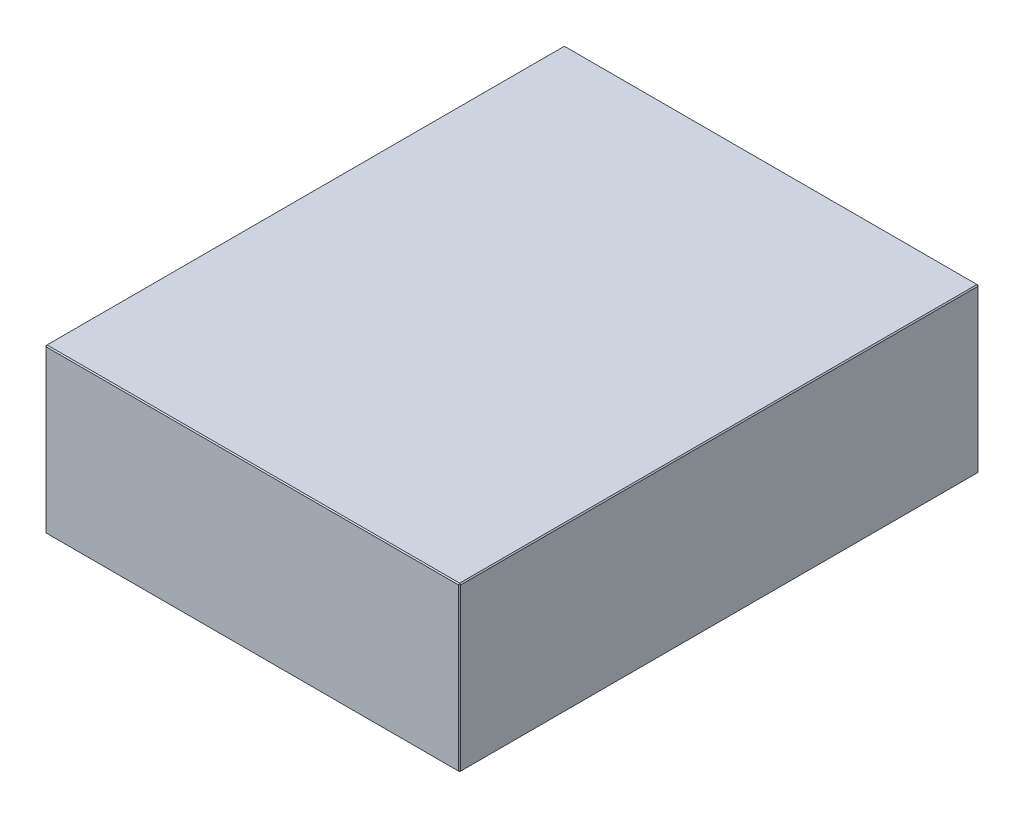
ISO-10303-21;
HEADER;
FILE_DESCRIPTION(('STEP AP214'),'2;1');
FILE_NAME('part.step','',(''),(''),'','','');
FILE_SCHEMA(('AUTOMOTIVE_DESIGN { 1 0 10303 214 1 1 1 1 }'));
ENDSEC;
DATA;
#1=APPLICATION_CONTEXT('core data for automotive mechanical design processes');
#2=APPLICATION_PROTOCOL_DEFINITION('international standard','automotive_design',2000,#1);
#3=PRODUCT_CONTEXT('',#1,'mechanical');
#4=PRODUCT('Part','Part','',(#3));
#5=PRODUCT_RELATED_PRODUCT_CATEGORY('part','',(#4));
#6=PRODUCT_DEFINITION_FORMATION('','',#4);
#7=PRODUCT_DEFINITION_CONTEXT('part definition',#1,'design');
#8=PRODUCT_DEFINITION('design','',#6,#7);
#9=PRODUCT_DEFINITION_SHAPE('','',#8);
#10=(LENGTH_UNIT() NAMED_UNIT(*) SI_UNIT(.MILLI.,.METRE.));
#11=(NAMED_UNIT(*) PLANE_ANGLE_UNIT() SI_UNIT($,.RADIAN.));
#12=(NAMED_UNIT(*) SI_UNIT($,.STERADIAN.) SOLID_ANGLE_UNIT());
#13=UNCERTAINTY_MEASURE_WITH_UNIT(LENGTH_MEASURE(1.E-05),#10,'distance_accuracy_value','');
#14=(GEOMETRIC_REPRESENTATION_CONTEXT(3) GLOBAL_UNCERTAINTY_ASSIGNED_CONTEXT((#13)) GLOBAL_UNIT_ASSIGNED_CONTEXT((#10,
#11,#12)) REPRESENTATION_CONTEXT('',''));
#15=CARTESIAN_POINT('',(0.,0.,0.));
#16=DIRECTION('',(0.,0.,1.));
#17=DIRECTION('',(1.,0.,0.));
#18=AXIS2_PLACEMENT_3D('',#15,#16,#17);
#19=CARTESIAN_POINT('',(-198.,156.,248.));
#20=DIRECTION('',(1.,0.,0.));
#21=DIRECTION('',(0.,0.,-1.));
#22=AXIS2_PLACEMENT_3D('',#19,#20,#21);
#23=PLANE('',#22);
#24=DIRECTION('',(0.,-1.,0.));
#25=VECTOR('',#24,1.);
#26=CARTESIAN_POINT('',(-198.,156.,-247.));
#27=LINE('',#26,#25);
#28=CARTESIAN_POINT('',(-198.,155.,-247.));
#29=VERTEX_POINT('',#28);
#30=CARTESIAN_POINT('',(-198.,1.,-247.));
#31=VERTEX_POINT('',#30);
#32=EDGE_CURVE('E114',#29,#31,#27,.T.);
#33=ORIENTED_EDGE('',*,*,#32,.T.);
#34=DIRECTION('',(0.,0.,1.));
#35=VECTOR('',#34,1.);
#36=CARTESIAN_POINT('',(-198.,1.,248.));
#37=LINE('',#36,#35);
#38=CARTESIAN_POINT('',(-198.,1.,247.));
#39=VERTEX_POINT('',#38);
#40=EDGE_CURVE('E110',#31,#39,#37,.T.);
#41=ORIENTED_EDGE('',*,*,#40,.T.);
#42=DIRECTION('',(0.,1.,0.));
#43=VECTOR('',#42,1.);
#44=CARTESIAN_POINT('',(-198.,156.,247.));
#45=LINE('',#44,#43);
#46=CARTESIAN_POINT('',(-198.,155.,247.));
#47=VERTEX_POINT('',#46);
#48=EDGE_CURVE('E103',#39,#47,#45,.T.);
#49=ORIENTED_EDGE('',*,*,#48,.T.);
#50=DIRECTION('',(0.,0.,-1.));
#51=VECTOR('',#50,1.);
#52=CARTESIAN_POINT('',(-198.,155.,-248.));
#53=LINE('',#52,#51);
#54=EDGE_CURVE('E107',#47,#29,#53,.T.);
#55=ORIENTED_EDGE('',*,*,#54,.T.);
#56=EDGE_LOOP('',(#33,#41,#49,#55));
#57=FACE_BOUND('',#56,.T.);
#58=ADVANCED_FACE('F15',(#57),#23,.F.);
#59=CARTESIAN_POINT('',(198.,156.,248.));
#60=DIRECTION('',(0.,0.,-1.));
#61=DIRECTION('',(-1.,0.,0.));
#62=AXIS2_PLACEMENT_3D('',#59,#60,#61);
#63=PLANE('',#62);
#64=DIRECTION('',(-1.,0.,0.));
#65=VECTOR('',#64,1.);
#66=CARTESIAN_POINT('',(-198.,155.,248.));
#67=LINE('',#66,#65);
#68=CARTESIAN_POINT('',(197.,155.,248.));
#69=VERTEX_POINT('',#68);
#70=CARTESIAN_POINT('',(-197.,155.,248.));
#71=VERTEX_POINT('',#70);
#72=EDGE_CURVE('E164',#69,#71,#67,.T.);
#73=ORIENTED_EDGE('',*,*,#72,.T.);
#74=DIRECTION('',(0.,-1.,0.));
#75=VECTOR('',#74,1.);
#76=CARTESIAN_POINT('',(-197.,156.,248.));
#77=LINE('',#76,#75);
#78=CARTESIAN_POINT('',(-197.,1.,248.));
#79=VERTEX_POINT('',#78);
#80=EDGE_CURVE('E122',#71,#79,#77,.T.);
#81=ORIENTED_EDGE('',*,*,#80,.T.);
#82=DIRECTION('',(1.,0.,0.));
#83=VECTOR('',#82,1.);
#84=CARTESIAN_POINT('',(198.,1.,248.));
#85=LINE('',#84,#83);
#86=CARTESIAN_POINT('',(197.,1.,248.));
#87=VERTEX_POINT('',#86);
#88=EDGE_CURVE('E168',#79,#87,#85,.T.);
#89=ORIENTED_EDGE('',*,*,#88,.T.);
#90=DIRECTION('',(0.,1.,0.));
#91=VECTOR('',#90,1.);
#92=CARTESIAN_POINT('',(197.,156.,248.));
#93=LINE('',#92,#91);
#94=EDGE_CURVE('E166',#87,#69,#93,.T.);
#95=ORIENTED_EDGE('',*,*,#94,.T.);
#96=EDGE_LOOP('',(#73,#81,#89,#95));
#97=FACE_BOUND('',#96,.T.);
#98=ADVANCED_FACE('F275',(#97),#63,.F.);
#99=CARTESIAN_POINT('',(198.,156.,248.));
#100=DIRECTION('',(-1.,0.,0.));
#101=DIRECTION('',(0.,0.,1.));
#102=AXIS2_PLACEMENT_3D('',#99,#100,#101);
#103=PLANE('',#102);
#104=DIRECTION('',(0.,0.,-1.));
#105=VECTOR('',#104,1.);
#106=CARTESIAN_POINT('',(198.,1.,248.));
#107=LINE('',#106,#105);
#108=CARTESIAN_POINT('',(198.,1.,247.));
#109=VERTEX_POINT('',#108);
#110=CARTESIAN_POINT('',(198.,1.,-247.));
#111=VERTEX_POINT('',#110);
#112=EDGE_CURVE('E159',#109,#111,#107,.T.);
#113=ORIENTED_EDGE('',*,*,#112,.T.);
#114=DIRECTION('',(0.,1.,0.));
#115=VECTOR('',#114,1.);
#116=CARTESIAN_POINT('',(198.,156.,-247.));
#117=LINE('',#116,#115);
#118=CARTESIAN_POINT('',(198.,155.,-247.));
#119=VERTEX_POINT('',#118);
#120=EDGE_CURVE('E161',#111,#119,#117,.T.);
#121=ORIENTED_EDGE('',*,*,#120,.T.);
#122=DIRECTION('',(0.,0.,1.));
#123=VECTOR('',#122,1.);
#124=CARTESIAN_POINT('',(198.,155.,248.));
#125=LINE('',#124,#123);
#126=CARTESIAN_POINT('',(198.,155.,247.));
#127=VERTEX_POINT('',#126);
#128=EDGE_CURVE('E155',#119,#127,#125,.T.);
#129=ORIENTED_EDGE('',*,*,#128,.T.);
#130=DIRECTION('',(0.,-1.,0.));
#131=VECTOR('',#130,1.);
#132=CARTESIAN_POINT('',(198.,156.,247.));
#133=LINE('',#132,#131);
#134=EDGE_CURVE('E157',#127,#109,#133,.T.);
#135=ORIENTED_EDGE('',*,*,#134,.T.);
#136=EDGE_LOOP('',(#113,#121,#129,#135));
#137=FACE_BOUND('',#136,.T.);
#138=ADVANCED_FACE('F254',(#137),#103,.F.);
#139=CARTESIAN_POINT('',(198.,156.,-248.));
#140=DIRECTION('',(0.,0.,1.));
#141=DIRECTION('',(1.,0.,0.));
#142=AXIS2_PLACEMENT_3D('',#139,#140,#141);
#143=PLANE('',#142);
#144=DIRECTION('',(0.,-1.,0.));
#145=VECTOR('',#144,1.);
#146=CARTESIAN_POINT('',(197.,156.,-248.));
#147=LINE('',#146,#145);
#148=CARTESIAN_POINT('',(197.,155.,-248.));
#149=VERTEX_POINT('',#148);
#150=CARTESIAN_POINT('',(197.,1.,-248.));
#151=VERTEX_POINT('',#150);
#152=EDGE_CURVE('E148',#149,#151,#147,.T.);
#153=ORIENTED_EDGE('',*,*,#152,.T.);
#154=DIRECTION('',(-1.,0.,0.));
#155=VECTOR('',#154,1.);
#156=CARTESIAN_POINT('',(198.,1.,-248.));
#157=LINE('',#156,#155);
#158=CARTESIAN_POINT('',(-197.,1.,-248.));
#159=VERTEX_POINT('',#158);
#160=EDGE_CURVE('E153',#151,#159,#157,.T.);
#161=ORIENTED_EDGE('',*,*,#160,.T.);
#162=DIRECTION('',(0.,1.,0.));
#163=VECTOR('',#162,1.);
#164=CARTESIAN_POINT('',(-197.,156.,-248.));
#165=LINE('',#164,#163);
#166=CARTESIAN_POINT('',(-197.,155.,-248.));
#167=VERTEX_POINT('',#166);
#168=EDGE_CURVE('E150',#159,#167,#165,.T.);
#169=ORIENTED_EDGE('',*,*,#168,.T.);
#170=DIRECTION('',(1.,0.,0.));
#171=VECTOR('',#170,1.);
#172=CARTESIAN_POINT('',(198.,155.,-248.));
#173=LINE('',#172,#171);
#174=EDGE_CURVE('E146',#167,#149,#173,.T.);
#175=ORIENTED_EDGE('',*,*,#174,.T.);
#176=EDGE_LOOP('',(#153,#161,#169,#175));
#177=FACE_BOUND('',#176,.T.);
#178=ADVANCED_FACE('F284',(#177),#143,.F.);
#179=CARTESIAN_POINT('',(0.,156.,0.));
#180=DIRECTION('',(0.,1.,0.));
#181=DIRECTION('',(0.,0.,1.));
#182=AXIS2_PLACEMENT_3D('',#179,#180,#181);
#183=PLANE('',#182);
#184=DIRECTION('',(0.,0.,-1.));
#185=VECTOR('',#184,1.);
#186=CARTESIAN_POINT('',(197.,156.,-248.));
#187=LINE('',#186,#185);
#188=CARTESIAN_POINT('',(197.,156.,247.));
#189=VERTEX_POINT('',#188);
#190=CARTESIAN_POINT('',(197.,156.,-247.));
#191=VERTEX_POINT('',#190);
#192=EDGE_CURVE('E24',#189,#191,#187,.T.);
#193=ORIENTED_EDGE('',*,*,#192,.T.);
#194=DIRECTION('',(-1.,0.,0.));
#195=VECTOR('',#194,1.);
#196=CARTESIAN_POINT('',(-198.,156.,-247.));
#197=LINE('',#196,#195);
#198=CARTESIAN_POINT('',(-197.,156.,-247.));
#199=VERTEX_POINT('',#198);
#200=EDGE_CURVE('E9',#191,#199,#197,.T.);
#201=ORIENTED_EDGE('',*,*,#200,.T.);
#202=DIRECTION('',(0.,0.,1.));
#203=VECTOR('',#202,1.);
#204=CARTESIAN_POINT('',(-197.,156.,248.));
#205=LINE('',#204,#203);
#206=CARTESIAN_POINT('',(-197.,156.,247.));
#207=VERTEX_POINT('',#206);
#208=EDGE_CURVE('E180',#199,#207,#205,.T.);
#209=ORIENTED_EDGE('',*,*,#208,.T.);
#210=DIRECTION('',(1.,0.,0.));
#211=VECTOR('',#210,1.);
#212=CARTESIAN_POINT('',(198.,156.,247.));
#213=LINE('',#212,#211);
#214=EDGE_CURVE('E35',#207,#189,#213,.T.);
#215=ORIENTED_EDGE('',*,*,#214,.T.);
#216=EDGE_LOOP('',(#193,#201,#209,#215));
#217=FACE_BOUND('',#216,.T.);
#218=ADVANCED_FACE('F350',(#217),#183,.T.);
#219=CARTESIAN_POINT('',(0.,0.,0.));
#220=DIRECTION('',(0.,1.,0.));
#221=DIRECTION('',(0.,0.,1.));
#222=AXIS2_PLACEMENT_3D('',#219,#220,#221);
#223=PLANE('',#222);
#224=DIRECTION('',(0.,0.,1.));
#225=VECTOR('',#224,1.);
#226=CARTESIAN_POINT('',(197.,0.,0.));
#227=LINE('',#226,#225);
#228=CARTESIAN_POINT('',(197.,0.,-247.));
#229=VERTEX_POINT('',#228);
#230=CARTESIAN_POINT('',(197.,0.,247.));
#231=VERTEX_POINT('',#230);
#232=EDGE_CURVE('E171',#229,#231,#227,.T.);
#233=ORIENTED_EDGE('',*,*,#232,.T.);
#234=DIRECTION('',(-1.,0.,0.));
#235=VECTOR('',#234,1.);
#236=CARTESIAN_POINT('',(0.,0.,247.));
#237=LINE('',#236,#235);
#238=CARTESIAN_POINT('',(-197.,0.,247.));
#239=VERTEX_POINT('',#238);
#240=EDGE_CURVE('E177',#231,#239,#237,.T.);
#241=ORIENTED_EDGE('',*,*,#240,.T.);
#242=DIRECTION('',(0.,0.,-1.));
#243=VECTOR('',#242,1.);
#244=CARTESIAN_POINT('',(-197.,0.,0.));
#245=LINE('',#244,#243);
#246=CARTESIAN_POINT('',(-197.,0.,-247.));
#247=VERTEX_POINT('',#246);
#248=EDGE_CURVE('E175',#239,#247,#245,.T.);
#249=ORIENTED_EDGE('',*,*,#248,.T.);
#250=DIRECTION('',(1.,0.,0.));
#251=VECTOR('',#250,1.);
#252=CARTESIAN_POINT('',(0.,0.,-247.));
#253=LINE('',#252,#251);
#254=EDGE_CURVE('E173',#247,#229,#253,.T.);
#255=ORIENTED_EDGE('',*,*,#254,.T.);
#256=EDGE_LOOP('',(#233,#241,#249,#255));
#257=FACE_BOUND('',#256,.T.);
#258=ADVANCED_FACE('F246',(#257),#223,.F.);
#259=CARTESIAN_POINT('',(198.,156.,247.));
#260=DIRECTION('',(-0.707106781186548,0.,-0.707106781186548));
#261=DIRECTION('',(0.,-1.,0.));
#262=AXIS2_PLACEMENT_3D('',#259,#260,#261);
#263=PLANE('',#262);
#264=DIRECTION('',(-0.707106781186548,0.,0.707106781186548));
#265=VECTOR('',#264,1.);
#266=CARTESIAN_POINT('',(197.,155.,248.));
#267=LINE('',#266,#265);
#268=EDGE_CURVE('E19',#69,#127,#267,.F.);
#269=ORIENTED_EDGE('',*,*,#268,.F.);
#270=ORIENTED_EDGE('',*,*,#94,.F.);
#271=DIRECTION('',(0.707106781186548,0.,-0.707106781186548));
#272=VECTOR('',#271,1.);
#273=CARTESIAN_POINT('',(197.,1.,248.));
#274=LINE('',#273,#272);
#275=EDGE_CURVE('E142',#109,#87,#274,.F.);
#276=ORIENTED_EDGE('',*,*,#275,.F.);
#277=ORIENTED_EDGE('',*,*,#134,.F.);
#278=EDGE_LOOP('',(#269,#270,#276,#277));
#279=FACE_BOUND('',#278,.T.);
#280=ADVANCED_FACE('F17',(#279),#263,.F.);
#281=CARTESIAN_POINT('',(197.,155.,248.));
#282=DIRECTION('',(0.577350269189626,0.577350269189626,0.577350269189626));
#283=DIRECTION('',(0.707106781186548,0.,-0.707106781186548));
#284=AXIS2_PLACEMENT_3D('',#281,#282,#283);
#285=PLANE('',#284);
#286=DIRECTION('',(0.,-0.707106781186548,0.707106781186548));
#287=VECTOR('',#286,1.);
#288=CARTESIAN_POINT('',(197.,155.,248.));
#289=LINE('',#288,#287);
#290=EDGE_CURVE('E226',#69,#189,#289,.F.);
#291=ORIENTED_EDGE('',*,*,#290,.F.);
#292=ORIENTED_EDGE('',*,*,#268,.T.);
#293=DIRECTION('',(-0.707106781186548,0.707106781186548,0.));
#294=VECTOR('',#293,1.);
#295=CARTESIAN_POINT('',(197.5,155.5,247.));
#296=LINE('',#295,#294);
#297=EDGE_CURVE('E228',#189,#127,#296,.F.);
#298=ORIENTED_EDGE('',*,*,#297,.F.);
#299=EDGE_LOOP('',(#291,#292,#298));
#300=FACE_BOUND('',#299,.T.);
#301=ADVANCED_FACE('F270',(#300),#285,.T.);
#302=CARTESIAN_POINT('',(197.,1.,248.));
#303=DIRECTION('',(0.577350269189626,-0.577350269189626,0.577350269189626));
#304=DIRECTION('',(0.707106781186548,0.,-0.707106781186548));
#305=AXIS2_PLACEMENT_3D('',#302,#303,#304);
#306=PLANE('',#305);
#307=DIRECTION('',(-0.707106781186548,-0.707106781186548,0.));
#308=VECTOR('',#307,1.);
#309=CARTESIAN_POINT('',(197.5,0.5,247.));
#310=LINE('',#309,#308);
#311=EDGE_CURVE('E220',#109,#231,#310,.T.);
#312=ORIENTED_EDGE('',*,*,#311,.F.);
#313=ORIENTED_EDGE('',*,*,#275,.T.);
#314=DIRECTION('',(0.,0.707106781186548,0.707106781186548));
#315=VECTOR('',#314,1.);
#316=CARTESIAN_POINT('',(197.,1.,248.));
#317=LINE('',#316,#315);
#318=EDGE_CURVE('E223',#231,#87,#317,.T.);
#319=ORIENTED_EDGE('',*,*,#318,.F.);
#320=EDGE_LOOP('',(#312,#313,#319));
#321=FACE_BOUND('',#320,.T.);
#322=ADVANCED_FACE('F235',(#321),#306,.T.);
#323=CARTESIAN_POINT('',(197.,156.,0.));
#324=DIRECTION('',(0.707106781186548,0.707106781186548,0.));
#325=DIRECTION('',(0.,0.,1.));
#326=AXIS2_PLACEMENT_3D('',#323,#324,#325);
#327=PLANE('',#326);
#328=ORIENTED_EDGE('',*,*,#297,.T.);
#329=ORIENTED_EDGE('',*,*,#128,.F.);
#330=DIRECTION('',(0.707106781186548,-0.707106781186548,0.));
#331=VECTOR('',#330,1.);
#332=CARTESIAN_POINT('',(198.,155.,-247.));
#333=LINE('',#332,#331);
#334=EDGE_CURVE('E215',#191,#119,#333,.T.);
#335=ORIENTED_EDGE('',*,*,#334,.F.);
#336=ORIENTED_EDGE('',*,*,#192,.F.);
#337=EDGE_LOOP('',(#328,#329,#335,#336));
#338=FACE_BOUND('',#337,.T.);
#339=ADVANCED_FACE('F265',(#338),#327,.T.);
#340=CARTESIAN_POINT('',(0.,156.,247.));
#341=DIRECTION('',(0.,0.707106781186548,0.707106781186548));
#342=DIRECTION('',(-1.,0.,0.));
#343=AXIS2_PLACEMENT_3D('',#340,#341,#342);
#344=PLANE('',#343);
#345=ORIENTED_EDGE('',*,*,#290,.T.);
#346=ORIENTED_EDGE('',*,*,#214,.F.);
#347=DIRECTION('',(0.,0.707106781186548,-0.707106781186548));
#348=VECTOR('',#347,1.);
#349=CARTESIAN_POINT('',(-197.,155.5,247.5));
#350=LINE('',#349,#348);
#351=EDGE_CURVE('E126',#71,#207,#350,.T.);
#352=ORIENTED_EDGE('',*,*,#351,.F.);
#353=ORIENTED_EDGE('',*,*,#72,.F.);
#354=EDGE_LOOP('',(#345,#346,#352,#353));
#355=FACE_BOUND('',#354,.T.);
#356=ADVANCED_FACE('F273',(#355),#344,.T.);
#357=CARTESIAN_POINT('',(-197.,156.,248.));
#358=DIRECTION('',(0.707106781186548,0.,-0.707106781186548));
#359=DIRECTION('',(0.,-1.,0.));
#360=AXIS2_PLACEMENT_3D('',#357,#358,#359);
#361=PLANE('',#360);
#362=DIRECTION('',(0.707106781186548,0.,0.707106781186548));
#363=VECTOR('',#362,1.);
#364=CARTESIAN_POINT('',(-197.,1.,248.));
#365=LINE('',#364,#363);
#366=EDGE_CURVE('E127',#79,#39,#365,.F.);
#367=ORIENTED_EDGE('',*,*,#366,.F.);
#368=ORIENTED_EDGE('',*,*,#80,.F.);
#369=DIRECTION('',(-0.707106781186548,0.,-0.707106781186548));
#370=VECTOR('',#369,1.);
#371=CARTESIAN_POINT('',(-198.,155.,247.));
#372=LINE('',#371,#370);
#373=EDGE_CURVE('E118',#47,#71,#372,.F.);
#374=ORIENTED_EDGE('',*,*,#373,.F.);
#375=ORIENTED_EDGE('',*,*,#48,.F.);
#376=EDGE_LOOP('',(#367,#368,#374,#375));
#377=FACE_BOUND('',#376,.T.);
#378=ADVANCED_FACE('F120',(#377),#361,.F.);
#379=CARTESIAN_POINT('',(198.,1.,248.));
#380=DIRECTION('',(0.,0.707106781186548,-0.707106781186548));
#381=DIRECTION('',(1.,0.,0.));
#382=AXIS2_PLACEMENT_3D('',#379,#380,#381);
#383=PLANE('',#382);
#384=ORIENTED_EDGE('',*,*,#318,.T.);
#385=ORIENTED_EDGE('',*,*,#88,.F.);
#386=DIRECTION('',(0.,-0.707106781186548,-0.707106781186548));
#387=VECTOR('',#386,1.);
#388=CARTESIAN_POINT('',(-197.,1.,248.));
#389=LINE('',#388,#387);
#390=EDGE_CURVE('E211',#239,#79,#389,.F.);
#391=ORIENTED_EDGE('',*,*,#390,.F.);
#392=ORIENTED_EDGE('',*,*,#240,.F.);
#393=EDGE_LOOP('',(#384,#385,#391,#392));
#394=FACE_BOUND('',#393,.T.);
#395=ADVANCED_FACE('F243',(#394),#383,.F.);
#396=CARTESIAN_POINT('',(198.,1.,248.));
#397=DIRECTION('',(-0.707106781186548,0.707106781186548,0.));
#398=DIRECTION('',(0.,0.,-1.));
#399=AXIS2_PLACEMENT_3D('',#396,#397,#398);
#400=PLANE('',#399);
#401=ORIENTED_EDGE('',*,*,#311,.T.);
#402=ORIENTED_EDGE('',*,*,#232,.F.);
#403=DIRECTION('',(0.707106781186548,0.707106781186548,0.));
#404=VECTOR('',#403,1.);
#405=CARTESIAN_POINT('',(197.5,0.500000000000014,-247.));
#406=LINE('',#405,#404);
#407=EDGE_CURVE('E208',#111,#229,#406,.F.);
#408=ORIENTED_EDGE('',*,*,#407,.F.);
#409=ORIENTED_EDGE('',*,*,#112,.F.);
#410=EDGE_LOOP('',(#401,#402,#408,#409));
#411=FACE_BOUND('',#410,.T.);
#412=ADVANCED_FACE('F251',(#411),#400,.F.);
#413=CARTESIAN_POINT('',(197.,156.,-248.));
#414=DIRECTION('',(-0.707106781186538,0.,0.707106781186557));
#415=DIRECTION('',(0.,-1.,0.));
#416=AXIS2_PLACEMENT_3D('',#413,#414,#415);
#417=PLANE('',#416);
#418=DIRECTION('',(0.707106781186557,0.,0.707106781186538));
#419=VECTOR('',#418,1.);
#420=CARTESIAN_POINT('',(198.,155.,-247.));
#421=LINE('',#420,#419);
#422=EDGE_CURVE('E217',#119,#149,#421,.F.);
#423=ORIENTED_EDGE('',*,*,#422,.F.);
#424=ORIENTED_EDGE('',*,*,#120,.F.);
#425=DIRECTION('',(-0.707106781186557,0.,-0.707106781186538));
#426=VECTOR('',#425,1.);
#427=CARTESIAN_POINT('',(197.,1.,-248.));
#428=LINE('',#427,#426);
#429=EDGE_CURVE('E205',#151,#111,#428,.F.);
#430=ORIENTED_EDGE('',*,*,#429,.F.);
#431=ORIENTED_EDGE('',*,*,#152,.F.);
#432=EDGE_LOOP('',(#423,#424,#430,#431));
#433=FACE_BOUND('',#432,.T.);
#434=ADVANCED_FACE('F258',(#433),#417,.F.);
#435=CARTESIAN_POINT('',(198.,155.,-247.));
#436=DIRECTION('',(0.577350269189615,0.577350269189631,-0.577350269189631));
#437=DIRECTION('',(0.,0.707106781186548,0.707106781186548));
#438=AXIS2_PLACEMENT_3D('',#435,#436,#437);
#439=PLANE('',#438);
#440=ORIENTED_EDGE('',*,*,#334,.T.);
#441=ORIENTED_EDGE('',*,*,#422,.T.);
#442=DIRECTION('',(0.,0.707106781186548,0.707106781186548));
#443=VECTOR('',#442,1.);
#444=CARTESIAN_POINT('',(197.,155.5,-247.5));
#445=LINE('',#444,#443);
#446=EDGE_CURVE('E134',#191,#149,#445,.F.);
#447=ORIENTED_EDGE('',*,*,#446,.F.);
#448=EDGE_LOOP('',(#440,#441,#447));
#449=FACE_BOUND('',#448,.T.);
#450=ADVANCED_FACE('F325',(#449),#439,.T.);
#451=CARTESIAN_POINT('',(-198.,155.,247.));
#452=DIRECTION('',(-0.577350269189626,0.577350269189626,0.577350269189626));
#453=DIRECTION('',(0.707106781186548,0.,0.707106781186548));
#454=AXIS2_PLACEMENT_3D('',#451,#452,#453);
#455=PLANE('',#454);
#456=ORIENTED_EDGE('',*,*,#373,.T.);
#457=ORIENTED_EDGE('',*,*,#351,.T.);
#458=DIRECTION('',(-0.707106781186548,-0.707106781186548,0.));
#459=VECTOR('',#458,1.);
#460=CARTESIAN_POINT('',(-198.,155.,247.));
#461=LINE('',#460,#459);
#462=EDGE_CURVE('E130',#47,#207,#461,.F.);
#463=ORIENTED_EDGE('',*,*,#462,.F.);
#464=EDGE_LOOP('',(#456,#457,#463));
#465=FACE_BOUND('',#464,.T.);
#466=ADVANCED_FACE('F131',(#465),#455,.T.);
#467=CARTESIAN_POINT('',(-197.,1.,248.));
#468=DIRECTION('',(-0.577350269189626,-0.577350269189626,0.577350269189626));
#469=DIRECTION('',(0.707106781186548,0.,0.707106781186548));
#470=AXIS2_PLACEMENT_3D('',#467,#468,#469);
#471=PLANE('',#470);
#472=ORIENTED_EDGE('',*,*,#390,.T.);
#473=ORIENTED_EDGE('',*,*,#366,.T.);
#474=DIRECTION('',(-0.707106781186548,0.707106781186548,0.));
#475=VECTOR('',#474,1.);
#476=CARTESIAN_POINT('',(-197.5,0.5,247.));
#477=LINE('',#476,#475);
#478=EDGE_CURVE('E135',#239,#39,#477,.T.);
#479=ORIENTED_EDGE('',*,*,#478,.F.);
#480=EDGE_LOOP('',(#472,#473,#479));
#481=FACE_BOUND('',#480,.T.);
#482=ADVANCED_FACE('F318',(#481),#471,.T.);
#483=CARTESIAN_POINT('',(197.,1.,-248.));
#484=DIRECTION('',(0.577350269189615,-0.577350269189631,-0.577350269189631));
#485=DIRECTION('',(0.,0.707106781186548,-0.707106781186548));
#486=AXIS2_PLACEMENT_3D('',#483,#484,#485);
#487=PLANE('',#486);
#488=ORIENTED_EDGE('',*,*,#429,.T.);
#489=ORIENTED_EDGE('',*,*,#407,.T.);
#490=DIRECTION('',(0.,-0.707106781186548,0.707106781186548));
#491=VECTOR('',#490,1.);
#492=CARTESIAN_POINT('',(197.,1.,-248.));
#493=LINE('',#492,#491);
#494=EDGE_CURVE('E198',#151,#229,#493,.T.);
#495=ORIENTED_EDGE('',*,*,#494,.F.);
#496=EDGE_LOOP('',(#488,#489,#495));
#497=FACE_BOUND('',#496,.T.);
#498=ADVANCED_FACE('F314',(#497),#487,.T.);
#499=CARTESIAN_POINT('',(0.,156.,-247.));
#500=DIRECTION('',(0.,0.707106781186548,-0.707106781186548));
#501=DIRECTION('',(1.,0.,0.));
#502=AXIS2_PLACEMENT_3D('',#499,#500,#501);
#503=PLANE('',#502);
#504=ORIENTED_EDGE('',*,*,#446,.T.);
#505=ORIENTED_EDGE('',*,*,#174,.F.);
#506=DIRECTION('',(0.,-0.707106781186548,-0.707106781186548));
#507=VECTOR('',#506,1.);
#508=CARTESIAN_POINT('',(-197.,155.,-248.));
#509=LINE('',#508,#507);
#510=EDGE_CURVE('E195',#199,#167,#509,.T.);
#511=ORIENTED_EDGE('',*,*,#510,.F.);
#512=ORIENTED_EDGE('',*,*,#200,.F.);
#513=EDGE_LOOP('',(#504,#505,#511,#512));
#514=FACE_BOUND('',#513,.T.);
#515=ADVANCED_FACE('F311',(#514),#503,.T.);
#516=CARTESIAN_POINT('',(-197.,156.,0.));
#517=DIRECTION('',(-0.707106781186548,0.707106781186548,0.));
#518=DIRECTION('',(0.,0.,-1.));
#519=AXIS2_PLACEMENT_3D('',#516,#517,#518);
#520=PLANE('',#519);
#521=ORIENTED_EDGE('',*,*,#462,.T.);
#522=ORIENTED_EDGE('',*,*,#208,.F.);
#523=DIRECTION('',(0.707106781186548,0.707106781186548,0.));
#524=VECTOR('',#523,1.);
#525=CARTESIAN_POINT('',(-197.5,155.5,-247.));
#526=LINE('',#525,#524);
#527=EDGE_CURVE('E138',#29,#199,#526,.T.);
#528=ORIENTED_EDGE('',*,*,#527,.F.);
#529=ORIENTED_EDGE('',*,*,#54,.F.);
#530=EDGE_LOOP('',(#521,#522,#528,#529));
#531=FACE_BOUND('',#530,.T.);
#532=ADVANCED_FACE('F137',(#531),#520,.T.);
#533=CARTESIAN_POINT('',(-198.,1.,248.));
#534=DIRECTION('',(0.707106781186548,0.707106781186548,0.));
#535=DIRECTION('',(0.,0.,1.));
#536=AXIS2_PLACEMENT_3D('',#533,#534,#535);
#537=PLANE('',#536);
#538=ORIENTED_EDGE('',*,*,#478,.T.);
#539=ORIENTED_EDGE('',*,*,#40,.F.);
#540=DIRECTION('',(0.707106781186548,-0.707106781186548,0.));
#541=VECTOR('',#540,1.);
#542=CARTESIAN_POINT('',(-198.,1.,-247.));
#543=LINE('',#542,#541);
#544=EDGE_CURVE('E191',#247,#31,#543,.F.);
#545=ORIENTED_EDGE('',*,*,#544,.F.);
#546=ORIENTED_EDGE('',*,*,#248,.F.);
#547=EDGE_LOOP('',(#538,#539,#545,#546));
#548=FACE_BOUND('',#547,.T.);
#549=ADVANCED_FACE('F304',(#548),#537,.F.);
#550=CARTESIAN_POINT('',(198.,1.,-248.));
#551=DIRECTION('',(0.,0.707106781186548,0.707106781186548));
#552=DIRECTION('',(-1.,0.,0.));
#553=AXIS2_PLACEMENT_3D('',#550,#551,#552);
#554=PLANE('',#553);
#555=ORIENTED_EDGE('',*,*,#494,.T.);
#556=ORIENTED_EDGE('',*,*,#254,.F.);
#557=DIRECTION('',(0.,0.707106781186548,-0.707106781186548));
#558=VECTOR('',#557,1.);
#559=CARTESIAN_POINT('',(-197.,0.499999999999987,-247.5));
#560=LINE('',#559,#558);
#561=EDGE_CURVE('E188',#159,#247,#560,.F.);
#562=ORIENTED_EDGE('',*,*,#561,.F.);
#563=ORIENTED_EDGE('',*,*,#160,.F.);
#564=EDGE_LOOP('',(#555,#556,#562,#563));
#565=FACE_BOUND('',#564,.T.);
#566=ADVANCED_FACE('F300',(#565),#554,.F.);
#567=CARTESIAN_POINT('',(-197.,155.,-248.));
#568=DIRECTION('',(-0.577350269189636,0.57735026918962,-0.57735026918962));
#569=DIRECTION('',(-0.707106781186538,0.,0.707106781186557));
#570=AXIS2_PLACEMENT_3D('',#567,#568,#569);
#571=PLANE('',#570);
#572=ORIENTED_EDGE('',*,*,#527,.T.);
#573=ORIENTED_EDGE('',*,*,#510,.T.);
#574=DIRECTION('',(0.707106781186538,0.,-0.707106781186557));
#575=VECTOR('',#574,1.);
#576=CARTESIAN_POINT('',(-197.,155.,-248.));
#577=LINE('',#576,#575);
#578=EDGE_CURVE('E186',#29,#167,#577,.T.);
#579=ORIENTED_EDGE('',*,*,#578,.F.);
#580=EDGE_LOOP('',(#572,#573,#579));
#581=FACE_BOUND('',#580,.T.);
#582=ADVANCED_FACE('F296',(#581),#571,.T.);
#583=CARTESIAN_POINT('',(-198.,1.,-247.));
#584=DIRECTION('',(-0.577350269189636,-0.57735026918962,-0.57735026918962));
#585=DIRECTION('',(-0.707106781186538,0.,0.707106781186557));
#586=AXIS2_PLACEMENT_3D('',#583,#584,#585);
#587=PLANE('',#586);
#588=ORIENTED_EDGE('',*,*,#561,.T.);
#589=ORIENTED_EDGE('',*,*,#544,.T.);
#590=DIRECTION('',(-0.707106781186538,0.,0.707106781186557));
#591=VECTOR('',#590,1.);
#592=CARTESIAN_POINT('',(-198.,1.,-247.));
#593=LINE('',#592,#591);
#594=EDGE_CURVE('E184',#159,#31,#593,.T.);
#595=ORIENTED_EDGE('',*,*,#594,.F.);
#596=EDGE_LOOP('',(#588,#589,#595));
#597=FACE_BOUND('',#596,.T.);
#598=ADVANCED_FACE('F292',(#597),#587,.T.);
#599=CARTESIAN_POINT('',(-198.,156.,-247.));
#600=DIRECTION('',(0.707106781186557,0.,0.707106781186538));
#601=DIRECTION('',(0.,-1.,0.));
#602=AXIS2_PLACEMENT_3D('',#599,#600,#601);
#603=PLANE('',#602);
#604=ORIENTED_EDGE('',*,*,#578,.T.);
#605=ORIENTED_EDGE('',*,*,#168,.F.);
#606=ORIENTED_EDGE('',*,*,#594,.T.);
#607=ORIENTED_EDGE('',*,*,#32,.F.);
#608=EDGE_LOOP('',(#604,#605,#606,#607));
#609=FACE_BOUND('',#608,.T.);
#610=ADVANCED_FACE('F289',(#609),#603,.F.);
#611=CLOSED_SHELL('',(#58,#98,#138,#178,#218,#258,#280,#301,#322,#339,#356,#378,#395,#412,#434,
#450,#466,#482,#498,#515,#532,#549,#566,#582,#598,#610));
#612=MANIFOLD_SOLID_BREP('B1',#611);
#613=ADVANCED_BREP_SHAPE_REPRESENTATION('',(#18,#612),#14);
#614=SHAPE_DEFINITION_REPRESENTATION(#9,#613);
ENDSEC;
END-ISO-10303-21;
